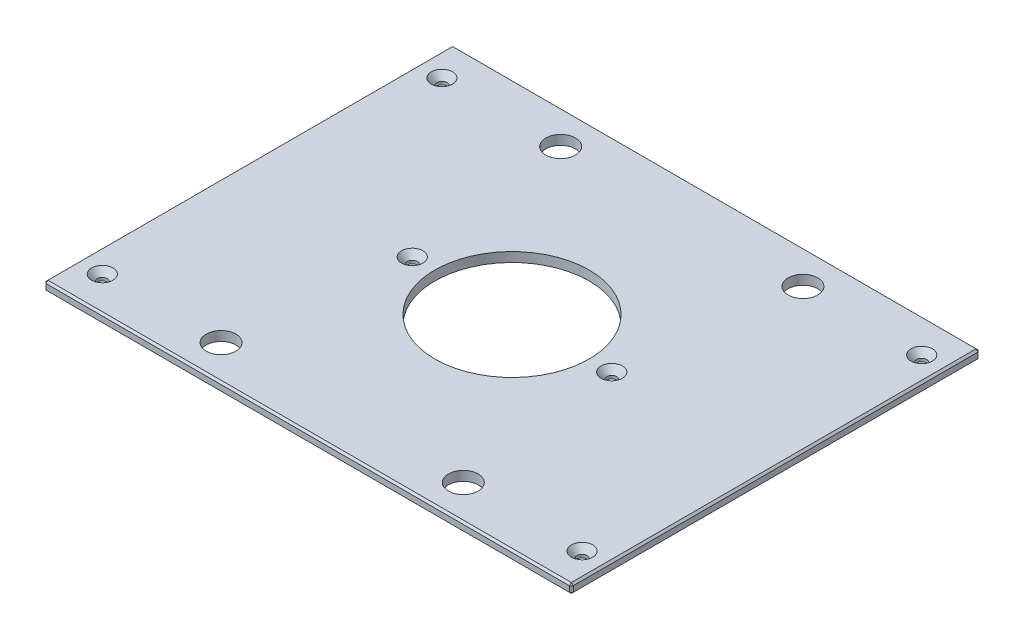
from build123d import *

# Parameters (mm, degrees)
SKETCH1_W                                     = 352.425
SKETCH1_H                                     = 273.05
BOSS_EXTRUDE1_DEPTH                           = 6.35
SKETCH13_R                                    = 51.562
CUT_EXTRUDE6_DEPTH                            = 224.002787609
F_25_32_0_78125_DIAMETER_HOLE1_D              = 19.84375
CHAMFER2_SIZE                                 = 1.27
CSK_FOR_1_4_FLAT_HEAD_MACHINE_SCREW1_AT_COUNT = 2
CSK_FOR_1_4_FLAT_HEAD_MACHINE_SCREW1_AT_PITCH = 227.00996
CSK_FOR_1_4_FLAT_HEAD_MACHINE_SCREW1_2_COUNT  = 2
CSK_FOR_1_4_FLAT_HEAD_MACHINE_SCREW1_2_PITCH  = 392.894359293
CSK_FOR_1_4_FLAT_HEAD_MACHINE_SCREW1_3_COUNT  = 2
CSK_FOR_1_4_FLAT_HEAD_MACHINE_SCREW1_3_PITCH  = 253.807122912
CSK_FOR_1_4_FLAT_HEAD_MACHINE_SCREW1_4_COUNT  = 2
CSK_FOR_1_4_FLAT_HEAD_MACHINE_SCREW1_4_PITCH  = 147.159927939
CSK_FOR_1_4_FLAT_HEAD_MACHINE_SCREW1_5_COUNT  = 2
CSK_FOR_1_4_FLAT_HEAD_MACHINE_SCREW1_5_PITCH  = 320.675
CSK_FOR_1_4_FLAT_HEAD_MACHINE_SCREW1_6_COUNT  = 2
CSK_FOR_1_4_FLAT_HEAD_MACHINE_SCREW1_6_PITCH  = 241.3
CSK_FOR_1_4_FLAT_HEAD_MACHINE_SCREW1_7_COUNT  = 2
CSK_FOR_1_4_FLAT_HEAD_MACHINE_SCREW1_7_PITCH  = 331.299278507


with BuildPart() as part:
    # Sketch1 → Boss-Extrude1 (new body)
    with BuildSketch(Plane(origin=(0, 0, 0), x_dir=(1, 0, 0), z_dir=(0, 1, 0))):
        Rectangle(SKETCH1_W, SKETCH1_H)
    extrude(amount=BOSS_EXTRUDE1_DEPTH)

    # Sketch13 → Cut-Extrude6 (cut, through all)
    with BuildSketch(Plane(origin=(0, 6.35, 0), x_dir=(1, 0, 0), z_dir=(0, 1, 0))):
        with Locations(Location((0, 0, 0), (0, 0, 270))):
            Circle(SKETCH13_R)
    extrude(amount=-CUT_EXTRUDE6_DEPTH, mode=Mode.SUBTRACT)

    # 25_32 _0.78125_ Diameter Hole1 (through all)
    with Locations(Plane(origin=(0, 6.35, 0), x_dir=(1, 0, 0), z_dir=(0, 1, 0))):
        with Locations((80.9625, 113.50498), (-80.9625, 113.50498), (80.9625, -113.50498), (-80.9625, -113.50498)):
            Hole(F_25_32_0_78125_DIAMETER_HOLE1_D / 2)

    # Chamfer2
    chamfer2_edges = [part.edges().sort_by_distance(p)[0] for p in [
        (176.2125, 6.35, 0),
        (0, 6.35, -136.525),
        (-176.2125, 6.35, 0),
        (0, 0, -136.525),
        (176.2125, 0, 0),
        (0, 0, 136.525),
        (-176.2125, 0, 0),
        (0, 6.35, 136.525),
        (-176.2125, 3.175, -136.525),
        (176.2125, 3.175, -136.525),
        (176.2125, 3.175, 136.525),
        (-176.2125, 3.175, 136.525),
    ]]
    chamfer(chamfer2_edges, length=CHAMFER2_SIZE)

    # Sketch24 → CSK for 1_4 Flat Head Machine Screw1 (revolve, cut)
    with BuildSketch(Plane(origin=(160.3375, 6.35, -113.50498), x_dir=(0, 0, 1), z_dir=(1, 0, 0))):
        Polygon((0, 0), (0, 6.35), (3.3782, 6.35), (3.3782, 4.324464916), (7.1374, 0), align=None)
    csk_for_1_4_flat_head_machine_screw1 = revolve(axis=Axis((160.3375, 12.7, -113.50498), (0, -1, 0)), mode=Mode.SUBTRACT)

    # CSK for 1_4 Flat Head Machine Screw1 at: CSK for 1_4 Flat Head Machine Screw1 ×2
    with Locations(*[(0, 0, i * CSK_FOR_1_4_FLAT_HEAD_MACHINE_SCREW1_AT_PITCH) for i in range(1, CSK_FOR_1_4_FLAT_HEAD_MACHINE_SCREW1_AT_COUNT)]):
        add(csk_for_1_4_flat_head_machine_screw1, mode=Mode.SUBTRACT)

    # CSK for 1_4 Flat Head Machine Screw1 2: CSK for 1_4 Flat Head Machine Screw1 ×2
    with Locations(*[Vector(-0.8161863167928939, 0, 0.5777887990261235) * (i * CSK_FOR_1_4_FLAT_HEAD_MACHINE_SCREW1_2_PITCH) for i in range(1, CSK_FOR_1_4_FLAT_HEAD_MACHINE_SCREW1_2_COUNT)]):
        add(csk_for_1_4_flat_head_machine_screw1, mode=Mode.SUBTRACT)

    # CSK for 1_4 Flat Head Machine Screw1 3: CSK for 1_4 Flat Head Machine Screw1 ×2
    with Locations(*[Vector(-0.8944291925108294, 0, 0.4472095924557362) * (i * CSK_FOR_1_4_FLAT_HEAD_MACHINE_SCREW1_3_PITCH) for i in range(1, CSK_FOR_1_4_FLAT_HEAD_MACHINE_SCREW1_3_COUNT)]):
        add(csk_for_1_4_flat_head_machine_screw1, mode=Mode.SUBTRACT)

    # CSK for 1_4 Flat Head Machine Screw1 4: CSK for 1_4 Flat Head Machine Screw1 ×2
    with Locations(*[Vector(-0.6364674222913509, 0, 0.7713035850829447) * (i * CSK_FOR_1_4_FLAT_HEAD_MACHINE_SCREW1_4_PITCH) for i in range(1, CSK_FOR_1_4_FLAT_HEAD_MACHINE_SCREW1_4_COUNT)]):
        add(csk_for_1_4_flat_head_machine_screw1, mode=Mode.SUBTRACT)

    # CSK for 1_4 Flat Head Machine Screw1 5: CSK for 1_4 Flat Head Machine Screw1 ×2
    with Locations(*[(-i * CSK_FOR_1_4_FLAT_HEAD_MACHINE_SCREW1_5_PITCH, 0, 0) for i in range(1, CSK_FOR_1_4_FLAT_HEAD_MACHINE_SCREW1_5_COUNT)]):
        add(csk_for_1_4_flat_head_machine_screw1, mode=Mode.SUBTRACT)

    # CSK for 1_4 Flat Head Machine Screw1 6: CSK for 1_4 Flat Head Machine Screw1 ×2
    with Locations(*[(-i * CSK_FOR_1_4_FLAT_HEAD_MACHINE_SCREW1_6_PITCH, 0, 0) for i in range(1, CSK_FOR_1_4_FLAT_HEAD_MACHINE_SCREW1_6_COUNT)]):
        add(csk_for_1_4_flat_head_machine_screw1, mode=Mode.SUBTRACT)

    # CSK for 1_4 Flat Head Machine Screw1 7: CSK for 1_4 Flat Head Machine Screw1 ×2
    with Locations(*[Vector(-0.7283444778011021, 0, 0.6852111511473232) * (i * CSK_FOR_1_4_FLAT_HEAD_MACHINE_SCREW1_7_PITCH) for i in range(1, CSK_FOR_1_4_FLAT_HEAD_MACHINE_SCREW1_7_COUNT)]):
        add(csk_for_1_4_flat_head_machine_screw1, mode=Mode.SUBTRACT)


solid = part.part
